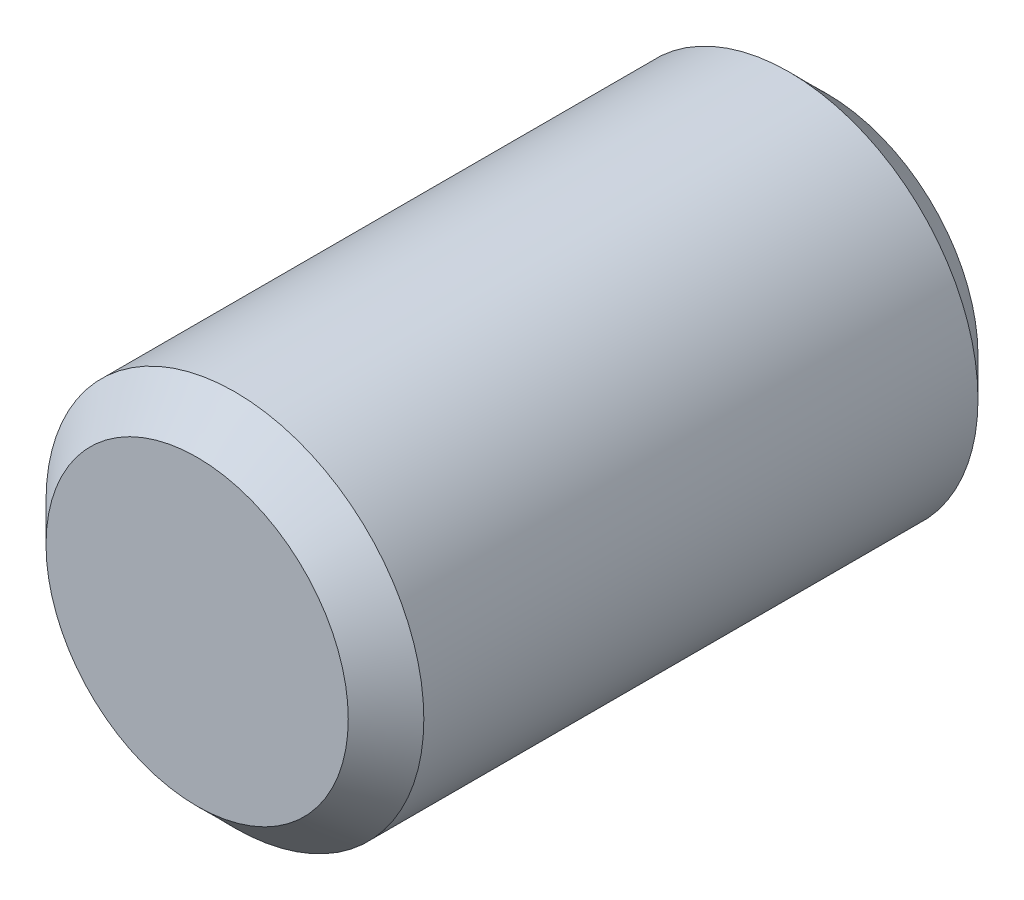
ISO-10303-21;
HEADER;
FILE_DESCRIPTION(('STEP AP214'),'2;1');
FILE_NAME('part.step','',(''),(''),'','','');
FILE_SCHEMA(('AUTOMOTIVE_DESIGN { 1 0 10303 214 1 1 1 1 }'));
ENDSEC;
DATA;
#1=APPLICATION_CONTEXT('core data for automotive mechanical design processes');
#2=APPLICATION_PROTOCOL_DEFINITION('international standard','automotive_design',2000,#1);
#3=PRODUCT_CONTEXT('',#1,'mechanical');
#4=PRODUCT('Part','Part','',(#3));
#5=PRODUCT_RELATED_PRODUCT_CATEGORY('part','',(#4));
#6=PRODUCT_DEFINITION_FORMATION('','',#4);
#7=PRODUCT_DEFINITION_CONTEXT('part definition',#1,'design');
#8=PRODUCT_DEFINITION('design','',#6,#7);
#9=PRODUCT_DEFINITION_SHAPE('','',#8);
#10=(LENGTH_UNIT() NAMED_UNIT(*) SI_UNIT(.MILLI.,.METRE.));
#11=(NAMED_UNIT(*) PLANE_ANGLE_UNIT() SI_UNIT($,.RADIAN.));
#12=(NAMED_UNIT(*) SI_UNIT($,.STERADIAN.) SOLID_ANGLE_UNIT());
#13=UNCERTAINTY_MEASURE_WITH_UNIT(LENGTH_MEASURE(1.E-05),#10,'distance_accuracy_value','');
#14=(GEOMETRIC_REPRESENTATION_CONTEXT(3) GLOBAL_UNCERTAINTY_ASSIGNED_CONTEXT((#13)) GLOBAL_UNIT_ASSIGNED_CONTEXT((#10,
#11,#12)) REPRESENTATION_CONTEXT('',''));
#15=CARTESIAN_POINT('',(0.,0.,0.));
#16=DIRECTION('',(0.,0.,1.));
#17=DIRECTION('',(1.,0.,0.));
#18=AXIS2_PLACEMENT_3D('',#15,#16,#17);
#19=CARTESIAN_POINT('',(0.,0.,5.));
#20=DIRECTION('',(0.,0.,-1.));
#21=DIRECTION('',(-1.,0.,0.));
#22=AXIS2_PLACEMENT_3D('',#19,#20,#21);
#23=CYLINDRICAL_SURFACE('',#22,1.5);
#24=CARTESIAN_POINT('',(0.,0.,0.299999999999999));
#25=DIRECTION('',(0.,0.,1.));
#26=DIRECTION('',(1.,0.,0.));
#27=AXIS2_PLACEMENT_3D('',#24,#25,#26);
#28=CIRCLE('',#27,1.5);
#29=CARTESIAN_POINT('',(1.5,0.,0.299999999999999));
#30=VERTEX_POINT('',#29);
#31=EDGE_CURVE('E143',#30,#30,#28,.T.);
#32=ORIENTED_EDGE('',*,*,#31,.T.);
#33=EDGE_LOOP('',(#32));
#34=FACE_BOUND('',#33,.T.);
#35=CARTESIAN_POINT('',(0.,0.,4.7));
#36=DIRECTION('',(0.,0.,1.));
#37=DIRECTION('',(1.,0.,0.));
#38=AXIS2_PLACEMENT_3D('',#35,#36,#37);
#39=CIRCLE('',#38,1.5);
#40=CARTESIAN_POINT('',(1.5,0.,4.7));
#41=VERTEX_POINT('',#40);
#42=EDGE_CURVE('E135',#41,#41,#39,.F.);
#43=ORIENTED_EDGE('',*,*,#42,.T.);
#44=EDGE_LOOP('',(#43));
#45=FACE_BOUND('',#44,.T.);
#46=ADVANCED_FACE('F33',(#34,#45),#23,.T.);
#47=CARTESIAN_POINT('',(0.,0.,5.));
#48=DIRECTION('',(0.,0.,1.));
#49=DIRECTION('',(1.,0.,0.));
#50=AXIS2_PLACEMENT_3D('',#47,#48,#49);
#51=PLANE('',#50);
#52=CARTESIAN_POINT('',(0.,0.,5.));
#53=DIRECTION('',(0.,0.,1.));
#54=DIRECTION('',(1.,0.,0.));
#55=AXIS2_PLACEMENT_3D('',#52,#53,#54);
#56=CIRCLE('',#55,1.2);
#57=CARTESIAN_POINT('',(1.2,0.,5.));
#58=VERTEX_POINT('',#57);
#59=EDGE_CURVE('E11',#58,#58,#56,.T.);
#60=ORIENTED_EDGE('',*,*,#59,.T.);
#61=EDGE_LOOP('',(#60));
#62=FACE_BOUND('',#61,.T.);
#63=ADVANCED_FACE('F157',(#62),#51,.T.);
#64=CARTESIAN_POINT('',(0.,0.,0.));
#65=DIRECTION('',(0.,0.,1.));
#66=DIRECTION('',(1.,0.,0.));
#67=AXIS2_PLACEMENT_3D('',#64,#65,#66);
#68=PLANE('',#67);
#69=DIRECTION('',(0.5,0.866025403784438,0.));
#70=VECTOR('',#69,1.);
#71=CARTESIAN_POINT('',(-1.15470053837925,0.,0.));
#72=LINE('',#71,#70);
#73=CARTESIAN_POINT('',(-1.15470053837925,0.,0.));
#74=VERTEX_POINT('',#73);
#75=CARTESIAN_POINT('',(-0.577350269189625,1.,0.));
#76=VERTEX_POINT('',#75);
#77=EDGE_CURVE('E122',#74,#76,#72,.T.);
#78=ORIENTED_EDGE('',*,*,#77,.F.);
#79=DIRECTION('',(-0.5,0.866025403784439,0.));
#80=VECTOR('',#79,1.);
#81=CARTESIAN_POINT('',(-0.577350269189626,-1.,0.));
#82=LINE('',#81,#80);
#83=CARTESIAN_POINT('',(-0.577350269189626,-1.,0.));
#84=VERTEX_POINT('',#83);
#85=EDGE_CURVE('E48',#84,#74,#82,.T.);
#86=ORIENTED_EDGE('',*,*,#85,.F.);
#87=DIRECTION('',(-1.,0.,0.));
#88=VECTOR('',#87,1.);
#89=CARTESIAN_POINT('',(0.577350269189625,-1.,0.));
#90=LINE('',#89,#88);
#91=CARTESIAN_POINT('',(0.577350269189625,-1.,0.));
#92=VERTEX_POINT('',#91);
#93=EDGE_CURVE('E131',#92,#84,#90,.T.);
#94=ORIENTED_EDGE('',*,*,#93,.F.);
#95=DIRECTION('',(-0.5,-0.866025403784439,0.));
#96=VECTOR('',#95,1.);
#97=CARTESIAN_POINT('',(1.15470053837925,0.,0.));
#98=LINE('',#97,#96);
#99=CARTESIAN_POINT('',(1.15470053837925,0.,0.));
#100=VERTEX_POINT('',#99);
#101=EDGE_CURVE('E129',#100,#92,#98,.T.);
#102=ORIENTED_EDGE('',*,*,#101,.F.);
#103=DIRECTION('',(0.5,-0.866025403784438,0.));
#104=VECTOR('',#103,1.);
#105=CARTESIAN_POINT('',(0.577350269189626,1.,0.));
#106=LINE('',#105,#104);
#107=CARTESIAN_POINT('',(0.577350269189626,1.,0.));
#108=VERTEX_POINT('',#107);
#109=EDGE_CURVE('E96',#108,#100,#106,.T.);
#110=ORIENTED_EDGE('',*,*,#109,.F.);
#111=DIRECTION('',(1.,0.,0.));
#112=VECTOR('',#111,1.);
#113=CARTESIAN_POINT('',(-0.577350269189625,1.,0.));
#114=LINE('',#113,#112);
#115=EDGE_CURVE('E125',#76,#108,#114,.T.);
#116=ORIENTED_EDGE('',*,*,#115,.F.);
#117=EDGE_LOOP('',(#78,#86,#94,#102,#110,#116));
#118=FACE_BOUND('',#117,.T.);
#119=CARTESIAN_POINT('',(0.,0.,0.));
#120=DIRECTION('',(0.,0.,1.));
#121=DIRECTION('',(1.,0.,0.));
#122=AXIS2_PLACEMENT_3D('',#119,#120,#121);
#123=CIRCLE('',#122,1.2);
#124=CARTESIAN_POINT('',(1.2,0.,0.));
#125=VERTEX_POINT('',#124);
#126=EDGE_CURVE('E41',#125,#125,#123,.F.);
#127=ORIENTED_EDGE('',*,*,#126,.T.);
#128=EDGE_LOOP('',(#127));
#129=FACE_BOUND('',#128,.T.);
#130=ADVANCED_FACE('F148',(#118,#129),#68,.F.);
#131=CARTESIAN_POINT('',(0.,0.,0.299999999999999));
#132=DIRECTION('',(0.,0.,1.));
#133=DIRECTION('',(1.,0.,0.));
#134=AXIS2_PLACEMENT_3D('',#131,#132,#133);
#135=CONICAL_SURFACE('',#134,1.5,0.785398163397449);
#136=ORIENTED_EDGE('',*,*,#126,.F.);
#137=EDGE_LOOP('',(#136));
#138=FACE_BOUND('',#137,.T.);
#139=ORIENTED_EDGE('',*,*,#31,.F.);
#140=EDGE_LOOP('',(#139));
#141=FACE_BOUND('',#140,.T.);
#142=ADVANCED_FACE('F150',(#138,#141),#135,.T.);
#143=CARTESIAN_POINT('',(0.,0.,5.));
#144=DIRECTION('',(0.,0.,-1.));
#145=DIRECTION('',(-1.,0.,0.));
#146=AXIS2_PLACEMENT_3D('',#143,#144,#145);
#147=CONICAL_SURFACE('',#146,1.2,0.785398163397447);
#148=ORIENTED_EDGE('',*,*,#42,.F.);
#149=EDGE_LOOP('',(#148));
#150=FACE_BOUND('',#149,.T.);
#151=ORIENTED_EDGE('',*,*,#59,.F.);
#152=EDGE_LOOP('',(#151));
#153=FACE_BOUND('',#152,.T.);
#154=ADVANCED_FACE('F35',(#150,#153),#147,.T.);
#155=CARTESIAN_POINT('',(-0.577350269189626,-1.,2.));
#156=DIRECTION('',(-0.866025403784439,-0.5,0.));
#157=DIRECTION('',(0.5,-0.866025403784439,0.));
#158=AXIS2_PLACEMENT_3D('',#155,#156,#157);
#159=PLANE('',#158);
#160=ORIENTED_EDGE('',*,*,#85,.T.);
#161=DIRECTION('',(0.,0.,-1.));
#162=VECTOR('',#161,1.);
#163=CARTESIAN_POINT('',(-1.15470053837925,0.,2.));
#164=LINE('',#163,#162);
#165=CARTESIAN_POINT('',(-1.15470053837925,0.,2.));
#166=VERTEX_POINT('',#165);
#167=EDGE_CURVE('E78',#166,#74,#164,.T.);
#168=ORIENTED_EDGE('',*,*,#167,.F.);
#169=DIRECTION('',(-0.5,0.866025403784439,0.));
#170=VECTOR('',#169,1.);
#171=CARTESIAN_POINT('',(-0.577350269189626,-1.,2.));
#172=LINE('',#171,#170);
#173=CARTESIAN_POINT('',(-0.577350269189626,-1.,2.));
#174=VERTEX_POINT('',#173);
#175=EDGE_CURVE('E133',#174,#166,#172,.T.);
#176=ORIENTED_EDGE('',*,*,#175,.F.);
#177=DIRECTION('',(0.,0.,-1.));
#178=VECTOR('',#177,1.);
#179=CARTESIAN_POINT('',(-0.577350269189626,-1.,2.));
#180=LINE('',#179,#178);
#181=EDGE_CURVE('E56',#174,#84,#180,.T.);
#182=ORIENTED_EDGE('',*,*,#181,.T.);
#183=EDGE_LOOP('',(#160,#168,#176,#182));
#184=FACE_BOUND('',#183,.T.);
#185=ADVANCED_FACE('F163',(#184),#159,.F.);
#186=CARTESIAN_POINT('',(0.577350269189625,-1.,2.));
#187=DIRECTION('',(0.,-1.,0.));
#188=DIRECTION('',(1.,0.,0.));
#189=AXIS2_PLACEMENT_3D('',#186,#187,#188);
#190=PLANE('',#189);
#191=ORIENTED_EDGE('',*,*,#93,.T.);
#192=ORIENTED_EDGE('',*,*,#181,.F.);
#193=DIRECTION('',(-1.,0.,0.));
#194=VECTOR('',#193,1.);
#195=CARTESIAN_POINT('',(0.577350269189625,-1.,2.));
#196=LINE('',#195,#194);
#197=CARTESIAN_POINT('',(0.577350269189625,-1.,2.));
#198=VERTEX_POINT('',#197);
#199=EDGE_CURVE('E108',#198,#174,#196,.T.);
#200=ORIENTED_EDGE('',*,*,#199,.F.);
#201=DIRECTION('',(0.,0.,-1.));
#202=VECTOR('',#201,1.);
#203=CARTESIAN_POINT('',(0.577350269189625,-1.,2.));
#204=LINE('',#203,#202);
#205=EDGE_CURVE('E100',#198,#92,#204,.T.);
#206=ORIENTED_EDGE('',*,*,#205,.T.);
#207=EDGE_LOOP('',(#191,#192,#200,#206));
#208=FACE_BOUND('',#207,.T.);
#209=ADVANCED_FACE('F176',(#208),#190,.F.);
#210=CARTESIAN_POINT('',(1.15470053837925,0.,2.));
#211=DIRECTION('',(0.866025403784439,-0.5,0.));
#212=DIRECTION('',(0.5,0.866025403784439,0.));
#213=AXIS2_PLACEMENT_3D('',#210,#211,#212);
#214=PLANE('',#213);
#215=ORIENTED_EDGE('',*,*,#101,.T.);
#216=ORIENTED_EDGE('',*,*,#205,.F.);
#217=DIRECTION('',(-0.5,-0.866025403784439,0.));
#218=VECTOR('',#217,1.);
#219=CARTESIAN_POINT('',(1.15470053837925,0.,2.));
#220=LINE('',#219,#218);
#221=CARTESIAN_POINT('',(1.15470053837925,0.,2.));
#222=VERTEX_POINT('',#221);
#223=EDGE_CURVE('E104',#222,#198,#220,.T.);
#224=ORIENTED_EDGE('',*,*,#223,.F.);
#225=DIRECTION('',(0.,0.,-1.));
#226=VECTOR('',#225,1.);
#227=CARTESIAN_POINT('',(1.15470053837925,0.,2.));
#228=LINE('',#227,#226);
#229=EDGE_CURVE('E89',#222,#100,#228,.T.);
#230=ORIENTED_EDGE('',*,*,#229,.T.);
#231=EDGE_LOOP('',(#215,#216,#224,#230));
#232=FACE_BOUND('',#231,.T.);
#233=ADVANCED_FACE('F105',(#232),#214,.F.);
#234=CARTESIAN_POINT('',(0.577350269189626,1.,2.));
#235=DIRECTION('',(0.866025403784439,0.5,0.));
#236=DIRECTION('',(-0.5,0.866025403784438,0.));
#237=AXIS2_PLACEMENT_3D('',#234,#235,#236);
#238=PLANE('',#237);
#239=ORIENTED_EDGE('',*,*,#109,.T.);
#240=ORIENTED_EDGE('',*,*,#229,.F.);
#241=DIRECTION('',(0.5,-0.866025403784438,0.));
#242=VECTOR('',#241,1.);
#243=CARTESIAN_POINT('',(0.577350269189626,1.,2.));
#244=LINE('',#243,#242);
#245=CARTESIAN_POINT('',(0.577350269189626,1.,2.));
#246=VERTEX_POINT('',#245);
#247=EDGE_CURVE('E93',#246,#222,#244,.T.);
#248=ORIENTED_EDGE('',*,*,#247,.F.);
#249=DIRECTION('',(0.,0.,-1.));
#250=VECTOR('',#249,1.);
#251=CARTESIAN_POINT('',(0.577350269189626,1.,2.));
#252=LINE('',#251,#250);
#253=EDGE_CURVE('E101',#246,#108,#252,.T.);
#254=ORIENTED_EDGE('',*,*,#253,.T.);
#255=EDGE_LOOP('',(#239,#240,#248,#254));
#256=FACE_BOUND('',#255,.T.);
#257=ADVANCED_FACE('F91',(#256),#238,.F.);
#258=CARTESIAN_POINT('',(-0.577350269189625,1.,2.));
#259=DIRECTION('',(0.,1.,0.));
#260=DIRECTION('',(0.,0.,1.));
#261=AXIS2_PLACEMENT_3D('',#258,#259,#260);
#262=PLANE('',#261);
#263=ORIENTED_EDGE('',*,*,#115,.T.);
#264=ORIENTED_EDGE('',*,*,#253,.F.);
#265=DIRECTION('',(1.,0.,0.));
#266=VECTOR('',#265,1.);
#267=CARTESIAN_POINT('',(-0.577350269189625,1.,2.));
#268=LINE('',#267,#266);
#269=CARTESIAN_POINT('',(-0.577350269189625,1.,2.));
#270=VERTEX_POINT('',#269);
#271=EDGE_CURVE('E114',#270,#246,#268,.T.);
#272=ORIENTED_EDGE('',*,*,#271,.F.);
#273=DIRECTION('',(0.,0.,-1.));
#274=VECTOR('',#273,1.);
#275=CARTESIAN_POINT('',(-0.577350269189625,1.,2.));
#276=LINE('',#275,#274);
#277=EDGE_CURVE('E138',#270,#76,#276,.T.);
#278=ORIENTED_EDGE('',*,*,#277,.T.);
#279=EDGE_LOOP('',(#263,#264,#272,#278));
#280=FACE_BOUND('',#279,.T.);
#281=ADVANCED_FACE('F180',(#280),#262,.F.);
#282=CARTESIAN_POINT('',(-1.15470053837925,0.,2.));
#283=DIRECTION('',(-0.866025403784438,0.5,0.));
#284=DIRECTION('',(-0.5,-0.866025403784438,0.));
#285=AXIS2_PLACEMENT_3D('',#282,#283,#284);
#286=PLANE('',#285);
#287=ORIENTED_EDGE('',*,*,#77,.T.);
#288=ORIENTED_EDGE('',*,*,#277,.F.);
#289=DIRECTION('',(0.5,0.866025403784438,0.));
#290=VECTOR('',#289,1.);
#291=CARTESIAN_POINT('',(-1.15470053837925,0.,2.));
#292=LINE('',#291,#290);
#293=EDGE_CURVE('E116',#166,#270,#292,.T.);
#294=ORIENTED_EDGE('',*,*,#293,.F.);
#295=ORIENTED_EDGE('',*,*,#167,.T.);
#296=EDGE_LOOP('',(#287,#288,#294,#295));
#297=FACE_BOUND('',#296,.T.);
#298=ADVANCED_FACE('F177',(#297),#286,.F.);
#299=CARTESIAN_POINT('',(-1.15470053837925,0.,2.));
#300=DIRECTION('',(0.,0.,-1.));
#301=DIRECTION('',(-1.,0.,0.));
#302=AXIS2_PLACEMENT_3D('',#299,#300,#301);
#303=PLANE('',#302);
#304=ORIENTED_EDGE('',*,*,#175,.T.);
#305=ORIENTED_EDGE('',*,*,#293,.T.);
#306=ORIENTED_EDGE('',*,*,#271,.T.);
#307=ORIENTED_EDGE('',*,*,#247,.T.);
#308=ORIENTED_EDGE('',*,*,#223,.T.);
#309=ORIENTED_EDGE('',*,*,#199,.T.);
#310=EDGE_LOOP('',(#304,#305,#306,#307,#308,#309));
#311=FACE_BOUND('',#310,.T.);
#312=ADVANCED_FACE('F111',(#311),#303,.T.);
#313=CLOSED_SHELL('',(#46,#63,#130,#142,#154,#185,#209,#233,#257,#281,#298,#312));
#314=MANIFOLD_SOLID_BREP('B2',#313);
#315=ADVANCED_BREP_SHAPE_REPRESENTATION('',(#18,#314),#14);
#316=SHAPE_DEFINITION_REPRESENTATION(#9,#315);
ENDSEC;
END-ISO-10303-21;
